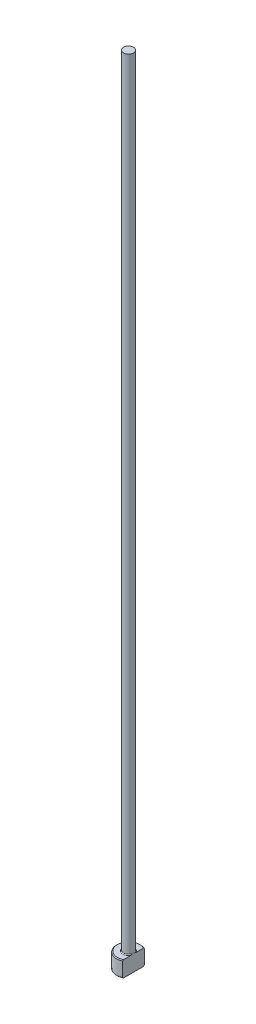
ISO-10303-21;
HEADER;
FILE_DESCRIPTION(('STEP AP214'),'2;1');
FILE_NAME('part.step','',(''),(''),'','','');
FILE_SCHEMA(('AUTOMOTIVE_DESIGN { 1 0 10303 214 1 1 1 1 }'));
ENDSEC;
DATA;
#1=APPLICATION_CONTEXT('core data for automotive mechanical design processes');
#2=APPLICATION_PROTOCOL_DEFINITION('international standard','automotive_design',2000,#1);
#3=PRODUCT_CONTEXT('',#1,'mechanical');
#4=PRODUCT('Part','Part','',(#3));
#5=PRODUCT_RELATED_PRODUCT_CATEGORY('part','',(#4));
#6=PRODUCT_DEFINITION_FORMATION('','',#4);
#7=PRODUCT_DEFINITION_CONTEXT('part definition',#1,'design');
#8=PRODUCT_DEFINITION('design','',#6,#7);
#9=PRODUCT_DEFINITION_SHAPE('','',#8);
#10=(LENGTH_UNIT() NAMED_UNIT(*) SI_UNIT(.MILLI.,.METRE.));
#11=(NAMED_UNIT(*) PLANE_ANGLE_UNIT() SI_UNIT($,.RADIAN.));
#12=(NAMED_UNIT(*) SI_UNIT($,.STERADIAN.) SOLID_ANGLE_UNIT());
#13=UNCERTAINTY_MEASURE_WITH_UNIT(LENGTH_MEASURE(1.E-05),#10,'distance_accuracy_value','');
#14=(GEOMETRIC_REPRESENTATION_CONTEXT(3) GLOBAL_UNCERTAINTY_ASSIGNED_CONTEXT((#13)) GLOBAL_UNIT_ASSIGNED_CONTEXT((#10,
#11,#12)) REPRESENTATION_CONTEXT('',''));
#15=CARTESIAN_POINT('',(0.,0.,0.));
#16=DIRECTION('',(0.,0.,1.));
#17=DIRECTION('',(1.,0.,0.));
#18=AXIS2_PLACEMENT_3D('',#15,#16,#17);
#19=CARTESIAN_POINT('',(0.,0.,0.));
#20=DIRECTION('',(0.,-1.,0.));
#21=DIRECTION('',(0.,0.,-1.));
#22=AXIS2_PLACEMENT_3D('',#19,#20,#21);
#23=PLANE('',#22);
#24=CARTESIAN_POINT('',(0.,0.,0.));
#25=DIRECTION('',(0.,-1.,0.));
#26=DIRECTION('',(0.,0.,-1.));
#27=AXIS2_PLACEMENT_3D('',#24,#25,#26);
#28=CIRCLE('',#27,2.79999999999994);
#29=CARTESIAN_POINT('',(1.24999999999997,0.,2.50549396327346));
#30=VERTEX_POINT('',#29);
#31=CARTESIAN_POINT('',(1.24999999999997,0.,-2.50549396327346));
#32=VERTEX_POINT('',#31);
#33=EDGE_CURVE('E98',#30,#32,#28,.T.);
#34=ORIENTED_EDGE('',*,*,#33,.T.);
#35=DIRECTION('',(0.,0.,1.));
#36=VECTOR('',#35,1.);
#37=CARTESIAN_POINT('',(1.24999999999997,0.,2.72717802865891));
#38=LINE('',#37,#36);
#39=EDGE_CURVE('E83',#32,#30,#38,.T.);
#40=ORIENTED_EDGE('',*,*,#39,.T.);
#41=EDGE_LOOP('',(#34,#40));
#42=FACE_BOUND('',#41,.T.);
#43=ADVANCED_FACE('F32',(#42),#23,.T.);
#44=CARTESIAN_POINT('',(0.,259.958771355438,0.));
#45=DIRECTION('',(0.,1.,0.));
#46=DIRECTION('',(0.,0.,1.));
#47=AXIS2_PLACEMENT_3D('',#44,#45,#46);
#48=CYLINDRICAL_SURFACE('',#47,2.99999999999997);
#49=CARTESIAN_POINT('',(0.,3.79999999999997,0.));
#50=DIRECTION('',(0.,1.,0.));
#51=DIRECTION('',(0.,0.,1.));
#52=AXIS2_PLACEMENT_3D('',#49,#50,#51);
#53=CIRCLE('',#52,2.99999999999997);
#54=CARTESIAN_POINT('',(1.24999999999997,3.79999999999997,2.72717802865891));
#55=VERTEX_POINT('',#54);
#56=CARTESIAN_POINT('',(1.24999999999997,3.79999999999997,-2.72717802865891));
#57=VERTEX_POINT('',#56);
#58=EDGE_CURVE('E104',#55,#57,#53,.F.);
#59=ORIENTED_EDGE('',*,*,#58,.T.);
#60=DIRECTION('',(0.,-1.,0.));
#61=VECTOR('',#60,1.);
#62=CARTESIAN_POINT('',(1.24999999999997,200.,-2.72717802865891));
#63=LINE('',#62,#61);
#64=CARTESIAN_POINT('',(1.24999999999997,0.200000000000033,-2.72717802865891));
#65=VERTEX_POINT('',#64);
#66=EDGE_CURVE('E183',#57,#65,#63,.T.);
#67=ORIENTED_EDGE('',*,*,#66,.T.);
#68=CARTESIAN_POINT('',(0.,0.200000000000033,0.));
#69=DIRECTION('',(0.,-1.,0.));
#70=DIRECTION('',(0.,0.,-1.));
#71=AXIS2_PLACEMENT_3D('',#68,#69,#70);
#72=CIRCLE('',#71,2.99999999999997);
#73=CARTESIAN_POINT('',(1.24999999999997,0.200000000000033,2.72717802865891));
#74=VERTEX_POINT('',#73);
#75=EDGE_CURVE('E100',#65,#74,#72,.F.);
#76=ORIENTED_EDGE('',*,*,#75,.T.);
#77=DIRECTION('',(0.,-1.,0.));
#78=VECTOR('',#77,1.);
#79=CARTESIAN_POINT('',(1.24999999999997,200.,2.72717802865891));
#80=LINE('',#79,#78);
#81=EDGE_CURVE('E93',#55,#74,#80,.T.);
#82=ORIENTED_EDGE('',*,*,#81,.F.);
#83=EDGE_LOOP('',(#59,#67,#76,#82));
#84=FACE_BOUND('',#83,.T.);
#85=ADVANCED_FACE('F158',(#84),#48,.T.);
#86=CARTESIAN_POINT('',(-2.99999999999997,4.,0.));
#87=DIRECTION('',(0.,1.,0.));
#88=DIRECTION('',(0.,0.,1.));
#89=AXIS2_PLACEMENT_3D('',#86,#87,#88);
#90=PLANE('',#89);
#91=CARTESIAN_POINT('',(0.,4.,0.));
#92=DIRECTION('',(0.,1.,0.));
#93=DIRECTION('',(0.,0.,1.));
#94=AXIS2_PLACEMENT_3D('',#91,#92,#93);
#95=CIRCLE('',#94,2.79999999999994);
#96=CARTESIAN_POINT('',(1.24999999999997,4.,-2.50549396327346));
#97=VERTEX_POINT('',#96);
#98=CARTESIAN_POINT('',(1.24999999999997,4.,2.50549396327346));
#99=VERTEX_POINT('',#98);
#100=EDGE_CURVE('E178',#97,#99,#95,.T.);
#101=ORIENTED_EDGE('',*,*,#100,.T.);
#102=DIRECTION('',(0.,0.,-1.));
#103=VECTOR('',#102,1.);
#104=CARTESIAN_POINT('',(1.24999999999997,4.,0.));
#105=LINE('',#104,#103);
#106=CARTESIAN_POINT('',(1.24999999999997,3.99999999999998,0.734846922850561));
#107=VERTEX_POINT('',#106);
#108=EDGE_CURVE('E57',#99,#107,#105,.T.);
#109=ORIENTED_EDGE('',*,*,#108,.T.);
#110=CARTESIAN_POINT('',(0.,4.,0.));
#111=DIRECTION('',(0.,1.,0.));
#112=DIRECTION('',(0.,0.,1.));
#113=AXIS2_PLACEMENT_3D('',#110,#111,#112);
#114=CIRCLE('',#113,1.44999999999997);
#115=CARTESIAN_POINT('',(1.24999999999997,3.99999999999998,-0.734846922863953));
#116=VERTEX_POINT('',#115);
#117=EDGE_CURVE('E107',#107,#116,#114,.F.);
#118=ORIENTED_EDGE('',*,*,#117,.T.);
#119=EDGE_CURVE('E136',#116,#97,#105,.T.);
#120=ORIENTED_EDGE('',*,*,#119,.T.);
#121=EDGE_LOOP('',(#101,#109,#118,#120));
#122=FACE_BOUND('',#121,.T.);
#123=ADVANCED_FACE('F147',(#122),#90,.T.);
#124=CARTESIAN_POINT('',(0.,4.,0.));
#125=DIRECTION('',(0.,-1.,0.));
#126=DIRECTION('',(0.,0.,-1.));
#127=AXIS2_PLACEMENT_3D('',#124,#125,#126);
#128=CONICAL_SURFACE('',#127,2.79999999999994,0.785398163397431);
#129=ORIENTED_EDGE('',*,*,#58,.F.);
#130=CARTESIAN_POINT('',(1.24999999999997,0.669029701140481,6.00219100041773));
#131=CARTESIAN_POINT('',(1.24999999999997,0.811608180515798,5.85654654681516));
#132=CARTESIAN_POINT('',(1.24999999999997,0.954083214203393,5.71080056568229));
#133=CARTESIAN_POINT('',(1.24999999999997,1.23900024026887,5.41878816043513));
#134=CARTESIAN_POINT('',(1.24999999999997,1.3814417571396,5.27252127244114));
#135=CARTESIAN_POINT('',(1.24999999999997,1.67009506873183,4.97540906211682));
#136=CARTESIAN_POINT('',(1.24999999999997,1.81629662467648,4.82455378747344));
#137=CARTESIAN_POINT('',(1.24999999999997,2.10796282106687,4.52263591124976));
#138=CARTESIAN_POINT('',(1.24999999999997,2.25342829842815,4.37157411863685));
#139=CARTESIAN_POINT('',(1.24999999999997,2.53664042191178,4.07620034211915));
#140=CARTESIAN_POINT('',(1.24999999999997,2.67441792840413,3.9319179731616));
#141=CARTESIAN_POINT('',(1.24999999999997,2.94919792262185,3.64255917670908));
#142=CARTESIAN_POINT('',(1.24999999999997,3.08620024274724,3.49748258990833));
#143=CARTESIAN_POINT('',(1.24999999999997,3.36003302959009,3.2052316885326));
#144=CARTESIAN_POINT('',(1.24999999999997,3.49685542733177,3.05804979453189));
#145=CARTESIAN_POINT('',(1.24999999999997,3.76866895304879,2.76222351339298));
#146=CARTESIAN_POINT('',(1.24999999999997,3.90366148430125,2.61358041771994));
#147=CARTESIAN_POINT('',(1.24999999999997,4.1672507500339,2.31803303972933));
#148=CARTESIAN_POINT('',(1.24999999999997,4.29592101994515,2.17119494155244));
#149=CARTESIAN_POINT('',(1.24999999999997,4.48585031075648,1.94789558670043));
#150=CARTESIAN_POINT('',(1.24999999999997,4.54874737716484,1.87283059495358));
#151=CARTESIAN_POINT('',(1.24999999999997,4.67301560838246,1.72146479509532));
#152=CARTESIAN_POINT('',(1.24999999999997,4.7343870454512,1.64516421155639));
#153=CARTESIAN_POINT('',(1.24999999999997,4.85417557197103,1.49197305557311));
#154=CARTESIAN_POINT('',(1.24999999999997,4.91262187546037,1.41510543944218));
#155=CARTESIAN_POINT('',(1.24999999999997,5.02658525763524,1.25910555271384));
#156=CARTESIAN_POINT('',(1.24999999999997,5.08209990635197,1.17997148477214));
#157=CARTESIAN_POINT('',(1.24999999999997,5.18831713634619,1.0191471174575));
#158=CARTESIAN_POINT('',(1.24999999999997,5.23904487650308,0.937473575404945));
#159=CARTESIAN_POINT('',(1.24999999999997,5.33341065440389,0.770163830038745));
#160=CARTESIAN_POINT('',(1.24999999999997,5.37706287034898,0.684536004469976));
#161=CARTESIAN_POINT('',(1.24999999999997,5.42311846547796,0.577571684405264));
#162=CARTESIAN_POINT('',(1.24999999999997,5.43098597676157,0.558575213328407));
#163=CARTESIAN_POINT('',(1.24999999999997,5.44613719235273,0.520340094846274));
#164=CARTESIAN_POINT('',(1.24999999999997,5.45342063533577,0.501101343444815));
#165=CARTESIAN_POINT('',(1.24999999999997,5.46734064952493,0.462392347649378));
#166=CARTESIAN_POINT('',(1.24999999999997,5.47397728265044,0.4429221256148));
#167=CARTESIAN_POINT('',(1.24999999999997,5.48654090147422,0.403756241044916));
#168=CARTESIAN_POINT('',(1.24999999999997,5.49246793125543,0.384060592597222));
#169=CARTESIAN_POINT('',(1.24999999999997,5.50889838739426,0.325328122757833));
#170=CARTESIAN_POINT('',(1.24999999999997,5.51829705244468,0.285972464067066));
#171=CARTESIAN_POINT('',(1.24999999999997,5.53364447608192,0.206573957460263));
#172=CARTESIAN_POINT('',(1.24999999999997,5.53959211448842,0.166530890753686));
#173=CARTESIAN_POINT('',(1.24999999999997,5.54775364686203,0.0853257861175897));
#174=CARTESIAN_POINT('',(1.24999999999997,5.54989812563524,0.0441566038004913));
#175=CARTESIAN_POINT('',(1.24999999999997,5.55009472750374,-0.0381787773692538));
#176=CARTESIAN_POINT('',(1.24999999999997,5.54814807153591,-0.0793449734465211));
#177=CARTESIAN_POINT('',(1.24999999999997,5.54028608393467,-0.161410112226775));
#178=CARTESIAN_POINT('',(1.24999999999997,5.53435930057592,-0.202307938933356));
#179=CARTESIAN_POINT('',(1.24999999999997,5.51889139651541,-0.283420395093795));
#180=CARTESIAN_POINT('',(1.24999999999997,5.50934853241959,-0.323634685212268));
#181=CARTESIAN_POINT('',(1.24999999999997,5.48253027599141,-0.419701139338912));
#182=CARTESIAN_POINT('',(1.24999999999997,5.46368943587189,-0.475114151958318));
#183=CARTESIAN_POINT('',(1.24999999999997,5.42119888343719,-0.584051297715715));
#184=CARTESIAN_POINT('',(1.24999999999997,5.3975461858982,-0.637574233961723));
#185=CARTESIAN_POINT('',(1.24999999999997,5.3465015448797,-0.743173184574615));
#186=CARTESIAN_POINT('',(1.24999999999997,5.31908834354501,-0.795238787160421));
#187=CARTESIAN_POINT('',(1.24999999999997,5.26156746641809,-0.897817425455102));
#188=CARTESIAN_POINT('',(1.24999999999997,5.23146075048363,-0.948331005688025));
#189=CARTESIAN_POINT('',(1.24999999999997,5.16421238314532,-1.05610178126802));
#190=CARTESIAN_POINT('',(1.24999999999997,5.12671791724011,-1.11313743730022));
#191=CARTESIAN_POINT('',(1.24999999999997,5.04971534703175,-1.22583866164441));
#192=CARTESIAN_POINT('',(1.24999999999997,5.01020681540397,-1.28150393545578));
#193=CARTESIAN_POINT('',(1.24999999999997,4.88938978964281,-1.44694956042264));
#194=CARTESIAN_POINT('',(1.24999999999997,4.80584655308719,-1.55509257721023));
#195=CARTESIAN_POINT('',(1.24999999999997,4.63502000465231,-1.76881938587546));
#196=CARTESIAN_POINT('',(1.24999999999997,4.54772710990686,-1.87439538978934));
#197=CARTESIAN_POINT('',(1.24999999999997,4.37088701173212,-2.08355531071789));
#198=CARTESIAN_POINT('',(1.24999999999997,4.28134083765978,-2.18714010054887));
#199=CARTESIAN_POINT('',(1.24999999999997,4.10042772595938,-2.39324626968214));
#200=CARTESIAN_POINT('',(1.24999999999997,4.00905617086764,-2.49576357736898));
#201=CARTESIAN_POINT('',(1.24999999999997,3.82518962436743,-2.69980391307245));
#202=CARTESIAN_POINT('',(1.24999999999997,3.73269451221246,-2.80132683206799));
#203=CARTESIAN_POINT('',(1.24999999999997,3.45429710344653,-3.10446128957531));
#204=CARTESIAN_POINT('',(1.24999999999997,3.26719139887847,-3.30496607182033));
#205=CARTESIAN_POINT('',(1.24999999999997,2.87989899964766,-3.71613563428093));
#206=CARTESIAN_POINT('',(1.24999999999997,2.67959819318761,-3.92669240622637));
#207=CARTESIAN_POINT('',(1.24999999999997,2.27757992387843,-4.34666060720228));
#208=CARTESIAN_POINT('',(1.24999999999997,2.07586177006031,-4.55607137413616));
#209=CARTESIAN_POINT('',(1.24999999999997,1.6735666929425,-4.97197982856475));
#210=CARTESIAN_POINT('',(1.24999999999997,1.47299831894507,-5.17848579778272));
#211=CARTESIAN_POINT('',(1.24999999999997,1.07135927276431,-5.59078665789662));
#212=CARTESIAN_POINT('',(1.24999999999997,0.87028893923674,-5.79658187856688));
#213=CARTESIAN_POINT('',(1.24999999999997,0.669029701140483,-6.00219100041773));
#214=B_SPLINE_CURVE_WITH_KNOTS('',3,(#130,#131,#132,#133,#134,#135,#136,#137,#138,#139,#140,
#141,#142,#143,#144,#145,#146,#147,#148,#149,#150,#151,#152,#153,#154,#155,#156,#157,#158,#159,
#160,#161,#162,#163,#164,#165,#166,#167,#168,#169,#170,#171,#172,#173,#174,#175,#176,#177,#178,
#179,#180,#181,#182,#183,#184,#185,#186,#187,#188,#189,#190,#191,#192,#193,#194,#195,#196,#197,
#198,#199,#200,#201,#202,#203,#204,#205,#206,#207,#208,#209,#210,#211,#212,#213),.UNSPECIFIED.,
.F.,.F.,(4,2,2,2,2,2,2,2,2,2,2,2,2,2,2,2,2,2,2,2,2,2,2,2,2,2,2,2,2,2,2,2,2,2,2,2,2,2,2,2,2,4),
(0.,0.611447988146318,1.22394436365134,1.85417356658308,2.48331351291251,3.08180969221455,
3.68043067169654,4.28328558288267,4.88564854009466,5.47129854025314,5.76508275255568,
6.05881415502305,6.34846123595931,6.63834474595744,6.92660821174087,7.21428670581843,
7.27596254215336,7.33766582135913,7.39936318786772,7.4610567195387,7.58229876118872,
7.70358013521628,7.82705319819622,7.95048941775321,8.07428232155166,8.19813498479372,
8.37340718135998,8.54878844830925,8.72520546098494,8.90155985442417,9.10626834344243,
9.31102044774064,9.72083602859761,10.1317697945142,10.5425191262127,10.9544882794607,
11.3665021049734,12.1892148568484,13.0610401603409,13.9333249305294,14.7969505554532,
15.660099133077),.UNSPECIFIED.);
#215=EDGE_CURVE('E135',#55,#99,#214,.T.);
#216=ORIENTED_EDGE('',*,*,#215,.T.);
#217=ORIENTED_EDGE('',*,*,#100,.F.);
#218=EDGE_CURVE('E127',#97,#57,#214,.T.);
#219=ORIENTED_EDGE('',*,*,#218,.T.);
#220=EDGE_LOOP('',(#129,#216,#217,#219));
#221=FACE_BOUND('',#220,.T.);
#222=ADVANCED_FACE('F143',(#221),#128,.T.);
#223=CARTESIAN_POINT('',(0.,0.200000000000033,0.));
#224=DIRECTION('',(0.,1.,0.));
#225=DIRECTION('',(0.,0.,1.));
#226=AXIS2_PLACEMENT_3D('',#223,#224,#225);
#227=CONICAL_SURFACE('',#226,2.99999999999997,0.785398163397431);
#228=ORIENTED_EDGE('',*,*,#75,.F.);
#229=CARTESIAN_POINT('',(1.24999999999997,3.33097029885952,-6.00219100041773));
#230=CARTESIAN_POINT('',(1.24999999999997,3.18839181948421,-5.85654654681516));
#231=CARTESIAN_POINT('',(1.24999999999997,3.04591678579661,-5.71080056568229));
#232=CARTESIAN_POINT('',(1.24999999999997,2.76099975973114,-5.41878816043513));
#233=CARTESIAN_POINT('',(1.24999999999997,2.61855824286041,-5.27252127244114));
#234=CARTESIAN_POINT('',(1.24999999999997,2.32990493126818,-4.97540906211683));
#235=CARTESIAN_POINT('',(1.24999999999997,2.18370337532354,-4.82455378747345));
#236=CARTESIAN_POINT('',(1.24999999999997,1.89203717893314,-4.52263591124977));
#237=CARTESIAN_POINT('',(1.24999999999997,1.74657170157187,-4.37157411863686));
#238=CARTESIAN_POINT('',(1.24999999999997,1.46335957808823,-4.07620034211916));
#239=CARTESIAN_POINT('',(1.24999999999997,1.32558207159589,-3.93191797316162));
#240=CARTESIAN_POINT('',(1.24999999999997,1.05080207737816,-3.64255917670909));
#241=CARTESIAN_POINT('',(1.24999999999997,0.913799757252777,-3.49748258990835));
#242=CARTESIAN_POINT('',(1.24999999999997,0.639966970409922,-3.2052316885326));
#243=CARTESIAN_POINT('',(1.24999999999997,0.503144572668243,-3.0580497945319));
#244=CARTESIAN_POINT('',(1.24999999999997,0.231331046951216,-2.76222351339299));
#245=CARTESIAN_POINT('',(1.24999999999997,0.09633851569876,-2.61358041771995));
#246=CARTESIAN_POINT('',(1.24999999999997,-0.167250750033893,-2.31803303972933));
#247=CARTESIAN_POINT('',(1.24999999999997,-0.295921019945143,-2.17119494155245));
#248=CARTESIAN_POINT('',(1.24999999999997,-0.485850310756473,-1.94789558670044));
#249=CARTESIAN_POINT('',(1.24999999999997,-0.54874737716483,-1.87283059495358));
#250=CARTESIAN_POINT('',(1.24999999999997,-0.673015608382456,-1.72146479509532));
#251=CARTESIAN_POINT('',(1.24999999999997,-0.734387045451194,-1.64516421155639));
#252=CARTESIAN_POINT('',(1.24999999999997,-0.854175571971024,-1.49197305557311));
#253=CARTESIAN_POINT('',(1.24999999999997,-0.912621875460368,-1.41510543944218));
#254=CARTESIAN_POINT('',(1.24999999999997,-1.02658525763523,-1.25910555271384));
#255=CARTESIAN_POINT('',(1.24999999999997,-1.08209990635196,-1.17997148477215));
#256=CARTESIAN_POINT('',(1.24999999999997,-1.18831713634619,-1.0191471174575));
#257=CARTESIAN_POINT('',(1.24999999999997,-1.23904487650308,-0.937473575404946));
#258=CARTESIAN_POINT('',(1.24999999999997,-1.33341065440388,-0.770163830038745));
#259=CARTESIAN_POINT('',(1.24999999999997,-1.37706287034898,-0.684536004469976));
#260=CARTESIAN_POINT('',(1.24999999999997,-1.42311846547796,-0.577571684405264));
#261=CARTESIAN_POINT('',(1.24999999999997,-1.43098597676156,-0.558575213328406));
#262=CARTESIAN_POINT('',(1.24999999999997,-1.44613719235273,-0.520340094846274));
#263=CARTESIAN_POINT('',(1.24999999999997,-1.45342063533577,-0.501101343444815));
#264=CARTESIAN_POINT('',(1.24999999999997,-1.46734064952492,-0.462392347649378));
#265=CARTESIAN_POINT('',(1.24999999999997,-1.47397728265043,-0.4429221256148));
#266=CARTESIAN_POINT('',(1.24999999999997,-1.48654090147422,-0.403756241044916));
#267=CARTESIAN_POINT('',(1.24999999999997,-1.49246793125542,-0.384060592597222));
#268=CARTESIAN_POINT('',(1.24999999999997,-1.50889838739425,-0.325328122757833));
#269=CARTESIAN_POINT('',(1.24999999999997,-1.51829705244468,-0.285972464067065));
#270=CARTESIAN_POINT('',(1.24999999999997,-1.53364447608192,-0.206573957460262));
#271=CARTESIAN_POINT('',(1.24999999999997,-1.53959211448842,-0.166530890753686));
#272=CARTESIAN_POINT('',(1.24999999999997,-1.54775364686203,-0.0853257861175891));
#273=CARTESIAN_POINT('',(1.24999999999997,-1.54989812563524,-0.0441566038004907));
#274=CARTESIAN_POINT('',(1.24999999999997,-1.55009472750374,0.0381787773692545));
#275=CARTESIAN_POINT('',(1.24999999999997,-1.5481480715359,0.0793449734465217));
#276=CARTESIAN_POINT('',(1.24999999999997,-1.54028608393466,0.161410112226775));
#277=CARTESIAN_POINT('',(1.24999999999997,-1.53435930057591,0.202307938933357));
#278=CARTESIAN_POINT('',(1.24999999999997,-1.5188913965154,0.283420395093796));
#279=CARTESIAN_POINT('',(1.24999999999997,-1.50934853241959,0.323634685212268));
#280=CARTESIAN_POINT('',(1.24999999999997,-1.48253027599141,0.419701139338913));
#281=CARTESIAN_POINT('',(1.24999999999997,-1.46368943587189,0.475114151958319));
#282=CARTESIAN_POINT('',(1.24999999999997,-1.42119888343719,0.584051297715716));
#283=CARTESIAN_POINT('',(1.24999999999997,-1.39754618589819,0.637574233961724));
#284=CARTESIAN_POINT('',(1.24999999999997,-1.3465015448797,0.743173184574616));
#285=CARTESIAN_POINT('',(1.24999999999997,-1.319088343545,0.795238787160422));
#286=CARTESIAN_POINT('',(1.24999999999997,-1.26156746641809,0.897817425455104));
#287=CARTESIAN_POINT('',(1.24999999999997,-1.23146075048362,0.948331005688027));
#288=CARTESIAN_POINT('',(1.24999999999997,-1.16421238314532,1.05610178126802));
#289=CARTESIAN_POINT('',(1.24999999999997,-1.1267179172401,1.11313743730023));
#290=CARTESIAN_POINT('',(1.24999999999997,-1.04971534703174,1.22583866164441));
#291=CARTESIAN_POINT('',(1.24999999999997,-1.01020681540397,1.28150393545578));
#292=CARTESIAN_POINT('',(1.24999999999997,-0.889389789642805,1.44694956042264));
#293=CARTESIAN_POINT('',(1.24999999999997,-0.805846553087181,1.55509257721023));
#294=CARTESIAN_POINT('',(1.24999999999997,-0.635020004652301,1.76881938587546));
#295=CARTESIAN_POINT('',(1.24999999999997,-0.547727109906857,1.87439538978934));
#296=CARTESIAN_POINT('',(1.24999999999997,-0.370887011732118,2.08355531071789));
#297=CARTESIAN_POINT('',(1.24999999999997,-0.281340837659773,2.18714010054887));
#298=CARTESIAN_POINT('',(1.24999999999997,-0.100427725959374,2.39324626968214));
#299=CARTESIAN_POINT('',(1.24999999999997,-0.00905617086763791,2.49576357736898));
#300=CARTESIAN_POINT('',(1.24999999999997,0.174810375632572,2.69980391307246));
#301=CARTESIAN_POINT('',(1.24999999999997,0.267305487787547,2.801326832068));
#302=CARTESIAN_POINT('',(1.24999999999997,0.545702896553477,3.10446128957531));
#303=CARTESIAN_POINT('',(1.24999999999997,0.73280860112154,3.30496607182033));
#304=CARTESIAN_POINT('',(1.24999999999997,1.12010100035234,3.71613563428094));
#305=CARTESIAN_POINT('',(1.24999999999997,1.3204018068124,3.92669240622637));
#306=CARTESIAN_POINT('',(1.24999999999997,1.72242007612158,4.34666060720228));
#307=CARTESIAN_POINT('',(1.24999999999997,1.92413822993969,4.55607137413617));
#308=CARTESIAN_POINT('',(1.24999999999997,2.32643330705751,4.97197982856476));
#309=CARTESIAN_POINT('',(1.24999999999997,2.52700168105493,5.17848579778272));
#310=CARTESIAN_POINT('',(1.24999999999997,2.92864072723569,5.59078665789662));
#311=CARTESIAN_POINT('',(1.24999999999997,3.12971106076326,5.79658187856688));
#312=CARTESIAN_POINT('',(1.24999999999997,3.33097029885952,6.00219100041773));
#313=B_SPLINE_CURVE_WITH_KNOTS('',3,(#229,#230,#231,#232,#233,#234,#235,#236,#237,#238,#239,
#240,#241,#242,#243,#244,#245,#246,#247,#248,#249,#250,#251,#252,#253,#254,#255,#256,#257,#258,
#259,#260,#261,#262,#263,#264,#265,#266,#267,#268,#269,#270,#271,#272,#273,#274,#275,#276,#277,
#278,#279,#280,#281,#282,#283,#284,#285,#286,#287,#288,#289,#290,#291,#292,#293,#294,#295,#296,
#297,#298,#299,#300,#301,#302,#303,#304,#305,#306,#307,#308,#309,#310,#311,#312),.UNSPECIFIED.,
.F.,.F.,(4,2,2,2,2,2,2,2,2,2,2,2,2,2,2,2,2,2,2,2,2,2,2,2,2,2,2,2,2,2,2,2,2,2,2,2,2,2,2,2,2,4),
(0.,0.611447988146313,1.22394436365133,1.85417356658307,2.48331351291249,3.08180969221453,
3.68043067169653,4.28328558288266,4.88564854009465,5.47129854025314,5.76508275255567,
6.05881415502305,6.3484612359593,6.63834474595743,6.92660821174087,7.21428670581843,
7.27596254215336,7.33766582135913,7.39936318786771,7.4610567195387,7.58229876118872,
7.70358013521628,7.82705319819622,7.95048941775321,8.07428232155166,8.19813498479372,
8.37340718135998,8.54878844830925,8.72520546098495,8.90155985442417,9.10626834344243,
9.31102044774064,9.72083602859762,10.1317697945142,10.5425191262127,10.9544882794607,
11.3665021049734,12.1892148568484,13.0610401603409,13.9333249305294,14.7969505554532,
15.660099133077),.UNSPECIFIED.);
#314=EDGE_CURVE('E86',#65,#32,#313,.T.);
#315=ORIENTED_EDGE('',*,*,#314,.T.);
#316=ORIENTED_EDGE('',*,*,#33,.F.);
#317=EDGE_CURVE('E89',#30,#74,#313,.T.);
#318=ORIENTED_EDGE('',*,*,#317,.T.);
#319=EDGE_LOOP('',(#228,#315,#316,#318));
#320=FACE_BOUND('',#319,.T.);
#321=ADVANCED_FACE('F97',(#320),#227,.T.);
#322=CARTESIAN_POINT('',(0.,4.19999999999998,0.));
#323=DIRECTION('',(0.,1.,0.));
#324=DIRECTION('',(0.,0.,1.));
#325=AXIS2_PLACEMENT_3D('',#322,#323,#324);
#326=TOROIDAL_SURFACE('',#325,1.44999999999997,0.2);
#327=CARTESIAN_POINT('',(1.24999999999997,4.19999999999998,0.));
#328=CARTESIAN_POINT('',(1.24999999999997,4.20000051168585,-1.97679442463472E-10));
#329=CARTESIAN_POINT('',(1.24999999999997,4.2000010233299,-1.08908064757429E-07));
#330=CARTESIAN_POINT('',(1.24999999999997,4.2000020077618,-4.52594763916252E-07));
#331=CARTESIAN_POINT('',(1.24999999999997,4.20000247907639,-6.9099304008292E-07));
#332=CARTESIAN_POINT('',(1.24999999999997,4.20000341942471,-1.26357943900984E-06));
#333=CARTESIAN_POINT('',(1.24999999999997,4.20000388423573,-1.60457618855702E-06));
#334=CARTESIAN_POINT('',(1.24999999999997,4.20000476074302,-2.3395490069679E-06));
#335=CARTESIAN_POINT('',(1.24999999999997,4.20000517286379,-2.73304148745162E-06));
#336=CARTESIAN_POINT('',(1.24999999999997,4.20000655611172,-4.1454401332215E-06));
#337=CARTESIAN_POINT('',(1.24999999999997,4.20000745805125,-5.23310092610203E-06));
#338=CARTESIAN_POINT('',(1.24999999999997,4.20000906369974,-7.47950361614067E-06));
#339=CARTESIAN_POINT('',(1.24999999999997,4.20000977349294,-8.63414438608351E-06));
#340=CARTESIAN_POINT('',(1.24999999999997,4.20001244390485,-1.31453477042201E-05));
#341=CARTESIAN_POINT('',(1.24999999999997,4.20001426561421,-1.65880555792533E-05));
#342=CARTESIAN_POINT('',(1.24999999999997,4.20001724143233,-2.33729029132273E-05));
#343=CARTESIAN_POINT('',(1.24999999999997,4.20001844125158,-2.66956154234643E-05));
#344=CARTESIAN_POINT('',(1.24999999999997,4.20002354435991,-4.08635086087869E-05));
#345=CARTESIAN_POINT('',(1.24999999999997,4.2000274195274,-5.17114614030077E-05));
#346=CARTESIAN_POINT('',(1.24999999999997,4.2000336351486,-7.2005767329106E-05));
#347=CARTESIAN_POINT('',(1.24999999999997,4.2000361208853,-8.14057065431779E-05));
#348=CARTESIAN_POINT('',(1.24999999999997,4.20005581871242,-0.00014978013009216));
#349=CARTESIAN_POINT('',(1.24999999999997,4.20008094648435,-0.000206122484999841));
#350=CARTESIAN_POINT('',(1.24999999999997,4.20017507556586,-0.000425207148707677));
#351=CARTESIAN_POINT('',(1.24999999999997,4.20023819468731,-0.000589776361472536));
#352=CARTESIAN_POINT('',(1.24999999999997,4.20048692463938,-0.00122878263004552));
#353=CARTESIAN_POINT('',(1.24999999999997,4.20067870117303,-0.00170134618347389));
#354=CARTESIAN_POINT('',(1.24999999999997,4.20146022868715,-0.00363636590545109));
#355=CARTESIAN_POINT('',(1.24999999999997,4.20204298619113,-0.0051009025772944));
#356=CARTESIAN_POINT('',(1.24999999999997,4.20939719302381,-0.0235712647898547));
#357=CARTESIAN_POINT('',(1.24999999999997,4.21621259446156,-0.0405643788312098));
#358=CARTESIAN_POINT('',(1.24999999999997,4.22951000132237,-0.0739606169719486));
#359=CARTESIAN_POINT('',(1.24999999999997,4.23599508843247,-0.0903626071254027));
#360=CARTESIAN_POINT('',(1.24999999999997,4.24961430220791,-0.12511129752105));
#361=CARTESIAN_POINT('',(1.24999999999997,4.25673641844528,-0.143462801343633));
#362=CARTESIAN_POINT('',(1.24999999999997,4.27085039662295,-0.180427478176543));
#363=CARTESIAN_POINT('',(1.24999999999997,4.27784022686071,-0.199041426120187));
#364=CARTESIAN_POINT('',(1.24999999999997,4.29479134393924,-0.245221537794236));
#365=CARTESIAN_POINT('',(1.24999999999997,4.30459026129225,-0.272848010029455));
#366=CARTESIAN_POINT('',(1.24999999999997,4.32310234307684,-0.327738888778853));
#367=CARTESIAN_POINT('',(1.24999999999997,4.3318356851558,-0.354996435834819));
#368=CARTESIAN_POINT('',(1.24999999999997,4.34936561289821,-0.413744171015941));
#369=CARTESIAN_POINT('',(1.24999999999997,4.35799470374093,-0.445285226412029));
#370=CARTESIAN_POINT('',(1.24999999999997,4.37338463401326,-0.50909191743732));
#371=CARTESIAN_POINT('',(1.24999999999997,4.38013036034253,-0.541361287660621));
#372=CARTESIAN_POINT('',(1.24999999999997,4.39136059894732,-0.608339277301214));
#373=CARTESIAN_POINT('',(1.24999999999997,4.39568167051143,-0.643076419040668));
#374=CARTESIAN_POINT('',(1.24999999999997,4.40037605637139,-0.712733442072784));
#375=CARTESIAN_POINT('',(1.24999999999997,4.40076553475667,-0.747651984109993));
#376=CARTESIAN_POINT('',(1.24999999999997,4.39677668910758,-0.808103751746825));
#377=CARTESIAN_POINT('',(1.24999999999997,4.39361441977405,-0.833711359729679));
#378=CARTESIAN_POINT('',(1.24999999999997,4.38355990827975,-0.883915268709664));
#379=CARTESIAN_POINT('',(1.24999999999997,4.37671813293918,-0.908520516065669));
#380=CARTESIAN_POINT('',(1.24999999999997,4.36252570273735,-0.944879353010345));
#381=CARTESIAN_POINT('',(1.24999999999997,4.35688428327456,-0.957298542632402));
#382=CARTESIAN_POINT('',(1.24999999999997,4.34399066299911,-0.981318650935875));
#383=CARTESIAN_POINT('',(1.24999999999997,4.33673636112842,-0.992918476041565));
#384=CARTESIAN_POINT('',(1.24999999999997,4.32199744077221,-1.01267533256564));
#385=CARTESIAN_POINT('',(1.24999999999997,4.31482723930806,-1.02106482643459));
#386=CARTESIAN_POINT('',(1.24999999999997,4.29924321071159,-1.03659690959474));
#387=CARTESIAN_POINT('',(1.24999999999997,4.29083198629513,-1.04374204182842));
#388=CARTESIAN_POINT('',(1.24999999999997,4.27498600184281,-1.05478694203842));
#389=CARTESIAN_POINT('',(1.24999999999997,4.26780814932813,-1.059053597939));
#390=CARTESIAN_POINT('',(1.24999999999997,4.25284782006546,-1.06635953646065));
#391=CARTESIAN_POINT('',(1.24999999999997,4.24506572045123,-1.06939957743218));
#392=CARTESIAN_POINT('',(1.24999999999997,4.22901828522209,-1.07404931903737));
#393=CARTESIAN_POINT('',(1.24999999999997,4.22074990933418,-1.07564870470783));
#394=CARTESIAN_POINT('',(1.24999999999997,4.20405985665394,-1.07723717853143));
#395=CARTESIAN_POINT('',(1.24999999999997,4.19563825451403,-1.07722703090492));
#396=CARTESIAN_POINT('',(1.24999999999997,4.17988128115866,-1.07569157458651));
#397=CARTESIAN_POINT('',(1.24999999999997,4.17252879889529,-1.0743339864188));
#398=CARTESIAN_POINT('',(1.24999999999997,4.15814333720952,-1.07044616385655));
#399=CARTESIAN_POINT('',(1.24999999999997,4.15111040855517,-1.06791574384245));
#400=CARTESIAN_POINT('',(1.24999999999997,4.13724955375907,-1.06171920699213));
#401=CARTESIAN_POINT('',(1.24999999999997,4.13043935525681,-1.05801386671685));
#402=CARTESIAN_POINT('',(1.24999999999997,4.11740316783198,-1.04969609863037));
#403=CARTESIAN_POINT('',(1.24999999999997,4.11117742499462,-1.04508329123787));
#404=CARTESIAN_POINT('',(1.24999999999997,4.09586196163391,-1.03220341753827));
#405=CARTESIAN_POINT('',(1.24999999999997,4.08723799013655,-1.02338140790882));
#406=CARTESIAN_POINT('',(1.24999999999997,4.07148817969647,-1.00448021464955));
#407=CARTESIAN_POINT('',(1.24999999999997,4.0643671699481,-0.994397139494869));
#408=CARTESIAN_POINT('',(1.24999999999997,4.04800089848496,-0.967694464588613));
#409=CARTESIAN_POINT('',(1.24999999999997,4.0397014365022,-0.950498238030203));
#410=CARTESIAN_POINT('',(1.24999999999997,4.02582422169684,-0.915117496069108));
#411=CARTESIAN_POINT('',(1.24999999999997,4.02024415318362,-0.896933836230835));
#412=CARTESIAN_POINT('',(1.24999999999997,4.00805724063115,-0.84678106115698));
#413=CARTESIAN_POINT('',(1.24999999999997,4.00359525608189,-0.814297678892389));
#414=CARTESIAN_POINT('',(1.24999999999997,3.99933348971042,-0.748574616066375));
#415=CARTESIAN_POINT('',(1.24999999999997,3.99961552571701,-0.715331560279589));
#416=CARTESIAN_POINT('',(1.24999999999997,4.00446632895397,-0.637920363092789));
#417=CARTESIAN_POINT('',(1.24999999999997,4.0104488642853,-0.593849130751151));
#418=CARTESIAN_POINT('',(1.24999999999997,4.02681929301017,-0.506401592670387));
#419=CARTESIAN_POINT('',(1.24999999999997,4.03722697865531,-0.463029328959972));
#420=CARTESIAN_POINT('',(1.24999999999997,4.06007158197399,-0.380638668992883));
#421=CARTESIAN_POINT('',(1.24999999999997,4.07227412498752,-0.341553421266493));
#422=CARTESIAN_POINT('',(1.24999999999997,4.09824323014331,-0.264347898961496));
#423=CARTESIAN_POINT('',(1.24999999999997,4.11199311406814,-0.226221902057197));
#424=CARTESIAN_POINT('',(1.24999999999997,4.13108825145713,-0.175350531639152));
#425=CARTESIAN_POINT('',(1.24999999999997,4.13599999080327,-0.162438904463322));
#426=CARTESIAN_POINT('',(1.24999999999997,4.14604281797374,-0.136318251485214));
#427=CARTESIAN_POINT('',(1.24999999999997,4.15117629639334,-0.123110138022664));
#428=CARTESIAN_POINT('',(1.24999999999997,4.163417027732,-0.0918425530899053));
#429=CARTESIAN_POINT('',(1.24999999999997,4.1705525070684,-0.0737943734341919));
#430=CARTESIAN_POINT('',(1.24999999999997,4.18426943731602,-0.0393586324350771));
#431=CARTESIAN_POINT('',(1.24999999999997,4.19084281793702,-0.0229681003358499));
#432=CARTESIAN_POINT('',(1.24999999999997,4.19795564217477,-0.00510438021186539));
#433=CARTESIAN_POINT('',(1.24999999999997,4.19853702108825,-0.00364331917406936));
#434=CARTESIAN_POINT('',(1.24999999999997,4.19931818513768,-0.0017091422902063));
#435=CARTESIAN_POINT('',(1.24999999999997,4.1995110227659,-0.00123396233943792));
#436=CARTESIAN_POINT('',(1.24999999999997,4.1997610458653,-0.000591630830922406));
#437=CARTESIAN_POINT('',(1.24999999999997,4.19982443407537,-0.000426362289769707));
#438=CARTESIAN_POINT('',(1.24999999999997,4.19991892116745,-0.0002064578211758));
#439=CARTESIAN_POINT('',(1.24999999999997,4.19994410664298,-0.000149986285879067));
#440=CARTESIAN_POINT('',(1.24999999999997,4.19996383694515,-8.14647488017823E-05));
#441=CARTESIAN_POINT('',(1.24999999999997,4.19996632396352,-7.2055156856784E-05));
#442=CARTESIAN_POINT('',(1.24999999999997,4.19997254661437,-5.17396177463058E-05));
#443=CARTESIAN_POINT('',(1.24999999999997,4.19997642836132,-4.08803464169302E-05));
#444=CARTESIAN_POINT('',(1.24999999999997,4.19998153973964,-2.66997573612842E-05));
#445=CARTESIAN_POINT('',(1.24999999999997,4.19998274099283,-2.33755458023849E-05));
#446=CARTESIAN_POINT('',(1.24999999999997,4.1999857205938,-1.65878758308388E-05));
#447=CARTESIAN_POINT('',(1.24999999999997,4.19998754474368,-1.3143899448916E-05));
#448=CARTESIAN_POINT('',(1.24999999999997,4.19999021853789,-8.63150514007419E-06));
#449=CARTESIAN_POINT('',(1.24999999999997,4.19999092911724,-7.47674883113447E-06));
#450=CARTESIAN_POINT('',(1.24999999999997,4.19999253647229,-5.23027083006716E-06));
#451=CARTESIAN_POINT('',(1.24999999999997,4.19999343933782,-4.14265823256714E-06));
#452=CARTESIAN_POINT('',(1.24999999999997,4.19999482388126,-2.73051192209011E-06));
#453=CARTESIAN_POINT('',(1.24999999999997,4.19999523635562,-2.33712919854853E-06));
#454=CARTESIAN_POINT('',(1.24999999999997,4.19999611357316,-1.60243918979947E-06));
#455=CARTESIAN_POINT('',(1.24999999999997,4.19999657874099,-1.26161621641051E-06));
#456=CARTESIAN_POINT('',(1.24999999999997,4.19999751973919,-6.89449599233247E-07));
#457=CARTESIAN_POINT('',(1.24999999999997,4.19999799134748,-4.51288703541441E-07));
#458=CARTESIAN_POINT('',(1.24999999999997,4.19999897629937,-1.08178111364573E-07));
#459=CARTESIAN_POINT('',(1.24999999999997,4.1999994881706,1.97734883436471E-10));
#460=CARTESIAN_POINT('',(1.24999999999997,4.19999999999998,0.));
#461=B_SPLINE_CURVE_WITH_KNOTS('',3,(#327,#328,#329,#330,#331,#332,#333,#334,#335,#336,#337,
#338,#339,#340,#341,#342,#343,#344,#345,#346,#347,#348,#349,#350,#351,#352,#353,#354,#355,#356,
#357,#358,#359,#360,#361,#362,#363,#364,#365,#366,#367,#368,#369,#370,#371,#372,#373,#374,#375,
#376,#377,#378,#379,#380,#381,#382,#383,#384,#385,#386,#387,#388,#389,#390,#391,#392,#393,#394,
#395,#396,#397,#398,#399,#400,#401,#402,#403,#404,#405,#406,#407,#408,#409,#410,#411,#412,#413,
#414,#415,#416,#417,#418,#419,#420,#421,#422,#423,#424,#425,#426,#427,#428,#429,#430,#431,#432,
#433,#434,#435,#436,#437,#438,#439,#440,#441,#442,#443,#444,#445,#446,#447,#448,#449,#450,#451,
#452,#453,#454,#455,#456,#457,#458,#459,#460),.UNSPECIFIED.,.T.,.F.,(4,2,2,2,2,2,2,2,2,2,2,2,2,
2,2,2,2,2,2,2,2,2,2,2,2,2,2,2,2,2,2,2,2,2,2,2,2,2,2,2,2,2,2,2,2,2,2,2,2,2,2,2,2,2,2,2,2,2,2,2,2,
2,2,2,2,2,4),(0.,1.53427573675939E-06,3.11115055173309E-06,4.83351634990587E-06,
6.54098944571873E-06,1.07594293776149E-05,1.48222851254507E-05,2.64707313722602E-05,
3.70576288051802E-05,7.16088726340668E-05,0.000100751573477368,0.000285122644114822,
0.000814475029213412,0.00234373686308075,0.00707317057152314,0.0619940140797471,
0.114907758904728,0.173961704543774,0.233609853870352,0.321537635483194,0.407388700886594,
0.505443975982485,0.604264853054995,0.709126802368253,0.813557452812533,0.890773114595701,
0.96695575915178,1.0077884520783,1.04867465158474,1.08167318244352,1.11460346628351,
1.13955805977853,1.16449720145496,1.18961351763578,1.21471790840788,1.23704542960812,
1.25937648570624,1.28254952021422,1.30573226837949,1.34253218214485,1.3794485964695,
1.43640829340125,1.49331940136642,1.591136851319,1.69064301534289,1.82371118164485,
1.95738088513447,2.08016146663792,2.20172662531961,2.24316968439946,2.28568093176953,
2.34390494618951,2.39687801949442,2.4015962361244,2.40313396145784,2.40366556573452,
2.40385035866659,2.40387953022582,2.40391411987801,2.40392471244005,2.40393636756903,
2.40394043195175,2.4039446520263,2.40394636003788,2.40394808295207,2.40394966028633,
2.40395119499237),.UNSPECIFIED.);
#462=CARTESIAN_POINT('',(1.24999999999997,4.19999999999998,0.));
#463=VERTEX_POINT('',#462);
#464=EDGE_CURVE('E11',#116,#463,#461,.T.);
#465=ORIENTED_EDGE('',*,*,#464,.F.);
#466=ORIENTED_EDGE('',*,*,#117,.F.);
#467=CARTESIAN_POINT('',(1.24999999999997,4.19999999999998,0.));
#468=CARTESIAN_POINT('',(1.24999999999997,4.19999948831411,1.97679415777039E-10));
#469=CARTESIAN_POINT('',(1.24999999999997,4.19999897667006,1.08908064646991E-07));
#470=CARTESIAN_POINT('',(1.24999999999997,4.19999799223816,4.52594763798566E-07));
#471=CARTESIAN_POINT('',(1.24999999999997,4.19999752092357,6.90993040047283E-07));
#472=CARTESIAN_POINT('',(1.24999999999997,4.19999658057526,1.26357943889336E-06));
#473=CARTESIAN_POINT('',(1.24999999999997,4.19999611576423,1.60457618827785E-06));
#474=CARTESIAN_POINT('',(1.24999999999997,4.19999523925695,2.33954900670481E-06));
#475=CARTESIAN_POINT('',(1.24999999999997,4.19999482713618,2.73304148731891E-06));
#476=CARTESIAN_POINT('',(1.24999999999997,4.19999344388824,4.14544013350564E-06));
#477=CARTESIAN_POINT('',(1.24999999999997,4.19999254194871,5.23310092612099E-06));
#478=CARTESIAN_POINT('',(1.24999999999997,4.19999093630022,7.47950361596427E-06));
#479=CARTESIAN_POINT('',(1.24999999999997,4.19999022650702,8.6341443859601E-06));
#480=CARTESIAN_POINT('',(1.24999999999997,4.19998755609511,1.31453477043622E-05));
#481=CARTESIAN_POINT('',(1.24999999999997,4.19998573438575,1.65880555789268E-05));
#482=CARTESIAN_POINT('',(1.24999999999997,4.19998275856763,2.33729029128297E-05));
#483=CARTESIAN_POINT('',(1.24999999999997,4.19998155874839,2.66956154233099E-05));
#484=CARTESIAN_POINT('',(1.24999999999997,4.19997645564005,4.08635086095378E-05));
#485=CARTESIAN_POINT('',(1.24999999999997,4.19997258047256,5.17114614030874E-05));
#486=CARTESIAN_POINT('',(1.24999999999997,4.19996636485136,7.200576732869E-05));
#487=CARTESIAN_POINT('',(1.24999999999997,4.19996387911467,8.14057065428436E-05));
#488=CARTESIAN_POINT('',(1.24999999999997,4.19994418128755,0.000149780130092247));
#489=CARTESIAN_POINT('',(1.24999999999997,4.19991905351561,0.000206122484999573));
#490=CARTESIAN_POINT('',(1.24999999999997,4.1998249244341,0.000425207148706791));
#491=CARTESIAN_POINT('',(1.24999999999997,4.19976180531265,0.000589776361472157));
#492=CARTESIAN_POINT('',(1.24999999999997,4.19951307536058,0.00122878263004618));
#493=CARTESIAN_POINT('',(1.24999999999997,4.19932129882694,0.00170134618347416));
#494=CARTESIAN_POINT('',(1.24999999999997,4.19853977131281,0.00363636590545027));
#495=CARTESIAN_POINT('',(1.24999999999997,4.19795701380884,0.00510090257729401));
#496=CARTESIAN_POINT('',(1.24999999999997,4.19060280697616,0.0235712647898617));
#497=CARTESIAN_POINT('',(1.24999999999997,4.18378740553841,0.0405643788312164));
#498=CARTESIAN_POINT('',(1.24999999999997,4.17048999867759,0.0739606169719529));
#499=CARTESIAN_POINT('',(1.24999999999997,4.16400491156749,0.090362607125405));
#500=CARTESIAN_POINT('',(1.24999999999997,4.15038569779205,0.125111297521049));
#501=CARTESIAN_POINT('',(1.24999999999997,4.14326358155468,0.143462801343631));
#502=CARTESIAN_POINT('',(1.24999999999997,4.12914960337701,0.180427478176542));
#503=CARTESIAN_POINT('',(1.24999999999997,4.12215977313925,0.199041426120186));
#504=CARTESIAN_POINT('',(1.24999999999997,4.10520865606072,0.245221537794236));
#505=CARTESIAN_POINT('',(1.24999999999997,4.09540973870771,0.272848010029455));
#506=CARTESIAN_POINT('',(1.24999999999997,4.07689765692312,0.327738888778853));
#507=CARTESIAN_POINT('',(1.24999999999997,4.06816431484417,0.354996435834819));
#508=CARTESIAN_POINT('',(1.24999999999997,4.05063438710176,0.413744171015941));
#509=CARTESIAN_POINT('',(1.24999999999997,4.04200529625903,0.445285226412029));
#510=CARTESIAN_POINT('',(1.24999999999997,4.0266153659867,0.50909191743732));
#511=CARTESIAN_POINT('',(1.24999999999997,4.01986963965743,0.541361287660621));
#512=CARTESIAN_POINT('',(1.24999999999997,4.00863940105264,0.608339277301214));
#513=CARTESIAN_POINT('',(1.24999999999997,4.00431832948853,0.643076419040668));
#514=CARTESIAN_POINT('',(1.24999999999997,3.99962394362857,0.712733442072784));
#515=CARTESIAN_POINT('',(1.24999999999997,3.99923446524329,0.747651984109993));
#516=CARTESIAN_POINT('',(1.24999999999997,4.00322331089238,0.808103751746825));
#517=CARTESIAN_POINT('',(1.24999999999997,4.00638558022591,0.833711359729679));
#518=CARTESIAN_POINT('',(1.24999999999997,4.01644009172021,0.883915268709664));
#519=CARTESIAN_POINT('',(1.24999999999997,4.02328186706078,0.908520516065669));
#520=CARTESIAN_POINT('',(1.24999999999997,4.03747429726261,0.944879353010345));
#521=CARTESIAN_POINT('',(1.24999999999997,4.0431157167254,0.957298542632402));
#522=CARTESIAN_POINT('',(1.24999999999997,4.05600933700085,0.981318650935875));
#523=CARTESIAN_POINT('',(1.24999999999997,4.06326363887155,0.992918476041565));
#524=CARTESIAN_POINT('',(1.24999999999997,4.07800255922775,1.01267533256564));
#525=CARTESIAN_POINT('',(1.24999999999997,4.08517276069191,1.02106482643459));
#526=CARTESIAN_POINT('',(1.24999999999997,4.10075678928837,1.03659690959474));
#527=CARTESIAN_POINT('',(1.24999999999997,4.10916801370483,1.04374204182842));
#528=CARTESIAN_POINT('',(1.24999999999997,4.12501399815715,1.05478694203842));
#529=CARTESIAN_POINT('',(1.24999999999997,4.13219185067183,1.059053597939));
#530=CARTESIAN_POINT('',(1.24999999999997,4.1471521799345,1.06635953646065));
#531=CARTESIAN_POINT('',(1.24999999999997,4.15493427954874,1.06939957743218));
#532=CARTESIAN_POINT('',(1.24999999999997,4.17098171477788,1.07404931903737));
#533=CARTESIAN_POINT('',(1.24999999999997,4.17925009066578,1.07564870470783));
#534=CARTESIAN_POINT('',(1.24999999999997,4.19594014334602,1.07723717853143));
#535=CARTESIAN_POINT('',(1.24999999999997,4.20436174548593,1.07722703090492));
#536=CARTESIAN_POINT('',(1.24999999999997,4.2201187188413,1.07569157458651));
#537=CARTESIAN_POINT('',(1.24999999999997,4.22747120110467,1.0743339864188));
#538=CARTESIAN_POINT('',(1.24999999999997,4.24185666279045,1.07044616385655));
#539=CARTESIAN_POINT('',(1.24999999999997,4.24888959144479,1.06791574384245));
#540=CARTESIAN_POINT('',(1.24999999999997,4.26275044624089,1.06171920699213));
#541=CARTESIAN_POINT('',(1.24999999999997,4.26956064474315,1.05801386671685));
#542=CARTESIAN_POINT('',(1.24999999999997,4.28259683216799,1.04969609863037));
#543=CARTESIAN_POINT('',(1.24999999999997,4.28882257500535,1.04508329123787));
#544=CARTESIAN_POINT('',(1.24999999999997,4.30413803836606,1.03220341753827));
#545=CARTESIAN_POINT('',(1.24999999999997,4.31276200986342,1.02338140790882));
#546=CARTESIAN_POINT('',(1.24999999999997,4.32851182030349,1.00448021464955));
#547=CARTESIAN_POINT('',(1.24999999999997,4.33563283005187,0.994397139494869));
#548=CARTESIAN_POINT('',(1.24999999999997,4.351999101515,0.967694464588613));
#549=CARTESIAN_POINT('',(1.24999999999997,4.36029856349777,0.950498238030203));
#550=CARTESIAN_POINT('',(1.24999999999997,4.37417577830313,0.915117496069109));
#551=CARTESIAN_POINT('',(1.24999999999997,4.37975584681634,0.896933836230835));
#552=CARTESIAN_POINT('',(1.24999999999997,4.39194275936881,0.84678106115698));
#553=CARTESIAN_POINT('',(1.24999999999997,4.39640474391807,0.814297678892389));
#554=CARTESIAN_POINT('',(1.24999999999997,4.40066651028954,0.748574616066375));
#555=CARTESIAN_POINT('',(1.24999999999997,4.40038447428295,0.715331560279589));
#556=CARTESIAN_POINT('',(1.24999999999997,4.395533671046,0.637920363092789));
#557=CARTESIAN_POINT('',(1.24999999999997,4.38955113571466,0.593849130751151));
#558=CARTESIAN_POINT('',(1.24999999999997,4.3731807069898,0.506401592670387));
#559=CARTESIAN_POINT('',(1.24999999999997,4.36277302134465,0.463029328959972));
#560=CARTESIAN_POINT('',(1.24999999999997,4.33992841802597,0.380638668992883));
#561=CARTESIAN_POINT('',(1.24999999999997,4.32772587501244,0.341553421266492));
#562=CARTESIAN_POINT('',(1.24999999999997,4.30175676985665,0.264347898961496));
#563=CARTESIAN_POINT('',(1.24999999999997,4.28800688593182,0.226221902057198));
#564=CARTESIAN_POINT('',(1.24999999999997,4.26891174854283,0.175350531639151));
#565=CARTESIAN_POINT('',(1.24999999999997,4.26400000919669,0.162438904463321));
#566=CARTESIAN_POINT('',(1.24999999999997,4.25395718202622,0.136318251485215));
#567=CARTESIAN_POINT('',(1.24999999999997,4.24882370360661,0.123110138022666));
#568=CARTESIAN_POINT('',(1.24999999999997,4.23658297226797,0.0918425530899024));
#569=CARTESIAN_POINT('',(1.24999999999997,4.22944749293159,0.0737943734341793));
#570=CARTESIAN_POINT('',(1.24999999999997,4.21573056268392,0.0393586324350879));
#571=CARTESIAN_POINT('',(1.24999999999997,4.20915718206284,0.0229681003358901));
#572=CARTESIAN_POINT('',(1.24999999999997,4.2020443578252,0.0051043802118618));
#573=CARTESIAN_POINT('',(1.24999999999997,4.20146297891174,0.00364331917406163));
#574=CARTESIAN_POINT('',(1.24999999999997,4.20068181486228,0.00170914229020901));
#575=CARTESIAN_POINT('',(1.24999999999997,4.20048897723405,0.0012339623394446));
#576=CARTESIAN_POINT('',(1.24999999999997,4.20023895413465,0.000591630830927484));
#577=CARTESIAN_POINT('',(1.24999999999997,4.20017556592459,0.000426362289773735));
#578=CARTESIAN_POINT('',(1.24999999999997,4.20008107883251,0.000206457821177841));
#579=CARTESIAN_POINT('',(1.24999999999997,4.20005589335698,0.000149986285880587));
#580=CARTESIAN_POINT('',(1.24999999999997,4.20003616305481,8.14647488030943E-05));
#581=CARTESIAN_POINT('',(1.24999999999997,4.20003367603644,7.20551568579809E-05));
#582=CARTESIAN_POINT('',(1.24999999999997,4.2000274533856,5.17396177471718E-05));
#583=CARTESIAN_POINT('',(1.24999999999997,4.20002357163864,4.08803464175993E-05));
#584=CARTESIAN_POINT('',(1.24999999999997,4.20001846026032,2.66997573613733E-05));
#585=CARTESIAN_POINT('',(1.24999999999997,4.20001725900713,2.33755458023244E-05));
#586=CARTESIAN_POINT('',(1.24999999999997,4.20001427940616,1.65878758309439E-05));
#587=CARTESIAN_POINT('',(1.24999999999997,4.20001245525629,1.31438994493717E-05));
#588=CARTESIAN_POINT('',(1.24999999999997,4.20000978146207,8.63150513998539E-06));
#589=CARTESIAN_POINT('',(1.24999999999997,4.20000907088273,7.47674883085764E-06));
#590=CARTESIAN_POINT('',(1.24999999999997,4.20000746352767,5.23027082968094E-06));
#591=CARTESIAN_POINT('',(1.24999999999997,4.20000656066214,4.14265823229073E-06));
#592=CARTESIAN_POINT('',(1.24999999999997,4.2000051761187,2.73051192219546E-06));
#593=CARTESIAN_POINT('',(1.24999999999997,4.20000476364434,2.33712919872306E-06));
#594=CARTESIAN_POINT('',(1.24999999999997,4.2000038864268,1.60243919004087E-06));
#595=CARTESIAN_POINT('',(1.24999999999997,4.20000342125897,1.2616162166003E-06));
#596=CARTESIAN_POINT('',(1.24999999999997,4.20000248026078,6.89449599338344E-07));
#597=CARTESIAN_POINT('',(1.24999999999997,4.20000200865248,4.51288703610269E-07));
#598=CARTESIAN_POINT('',(1.24999999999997,4.20000102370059,1.08178111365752E-07));
#599=CARTESIAN_POINT('',(1.24999999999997,4.20000051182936,-1.97734856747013E-10));
#600=CARTESIAN_POINT('',(1.24999999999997,4.19999999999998,0.));
#601=B_SPLINE_CURVE_WITH_KNOTS('',3,(#467,#468,#469,#470,#471,#472,#473,#474,#475,#476,#477,
#478,#479,#480,#481,#482,#483,#484,#485,#486,#487,#488,#489,#490,#491,#492,#493,#494,#495,#496,
#497,#498,#499,#500,#501,#502,#503,#504,#505,#506,#507,#508,#509,#510,#511,#512,#513,#514,#515,
#516,#517,#518,#519,#520,#521,#522,#523,#524,#525,#526,#527,#528,#529,#530,#531,#532,#533,#534,
#535,#536,#537,#538,#539,#540,#541,#542,#543,#544,#545,#546,#547,#548,#549,#550,#551,#552,#553,
#554,#555,#556,#557,#558,#559,#560,#561,#562,#563,#564,#565,#566,#567,#568,#569,#570,#571,#572,
#573,#574,#575,#576,#577,#578,#579,#580,#581,#582,#583,#584,#585,#586,#587,#588,#589,#590,#591,
#592,#593,#594,#595,#596,#597,#598,#599,#600),.UNSPECIFIED.,.T.,.F.,(4,2,2,2,2,2,2,2,2,2,2,2,2,
2,2,2,2,2,2,2,2,2,2,2,2,2,2,2,2,2,2,2,2,2,2,2,2,2,2,2,2,2,2,2,2,2,2,2,2,2,2,2,2,2,2,2,2,2,2,2,2,
2,2,2,2,2,4),(0.,1.53427573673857E-06,3.11115055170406E-06,4.83351635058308E-06,
6.54098944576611E-06,1.07594293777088E-05,1.4822285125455E-05,2.64707313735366E-05,
3.70576288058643E-05,7.16088726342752E-05,0.000100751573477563,0.000285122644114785,
0.000814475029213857,0.0023437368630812,0.00707317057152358,0.0619940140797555,
0.114907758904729,0.173961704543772,0.233609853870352,0.321537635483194,0.407388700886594,
0.505443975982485,0.604264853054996,0.709126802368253,0.813557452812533,0.890773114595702,
0.96695575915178,1.0077884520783,1.04867465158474,1.08167318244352,1.11460346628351,
1.13955805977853,1.16449720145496,1.18961351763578,1.21471790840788,1.23704542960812,
1.25937648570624,1.28254952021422,1.30573226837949,1.34253218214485,1.3794485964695,
1.43640829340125,1.49331940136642,1.591136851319,1.69064301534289,1.82371118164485,
1.95738088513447,2.08016146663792,2.20172662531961,2.24316968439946,2.28568093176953,
2.34390494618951,2.39687801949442,2.4015962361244,2.40313396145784,2.40366556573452,
2.40385035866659,2.40387953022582,2.40391411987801,2.40392471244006,2.40393636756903,
2.40394043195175,2.4039446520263,2.40394636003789,2.40394808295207,2.40394966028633,
2.40395119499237),.UNSPECIFIED.);
#602=EDGE_CURVE('E46',#463,#107,#601,.T.);
#603=ORIENTED_EDGE('',*,*,#602,.F.);
#604=CARTESIAN_POINT('',(0.,4.19999999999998,0.));
#605=DIRECTION('',(0.,1.,0.));
#606=DIRECTION('',(0.,0.,1.));
#607=AXIS2_PLACEMENT_3D('',#604,#605,#606);
#608=CIRCLE('',#607,1.24999999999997);
#609=EDGE_CURVE('E103',#463,#463,#608,.T.);
#610=ORIENTED_EDGE('',*,*,#609,.F.);
#611=EDGE_LOOP('',(#465,#466,#603,#610));
#612=FACE_BOUND('',#611,.T.);
#613=ADVANCED_FACE('F34',(#612),#326,.F.);
#614=CARTESIAN_POINT('',(0.,259.958771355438,0.));
#615=DIRECTION('',(0.,1.,0.));
#616=DIRECTION('',(0.,0.,1.));
#617=AXIS2_PLACEMENT_3D('',#614,#615,#616);
#618=CYLINDRICAL_SURFACE('',#617,1.24999999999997);
#619=ORIENTED_EDGE('',*,*,#609,.T.);
#620=EDGE_LOOP('',(#619));
#621=FACE_BOUND('',#620,.T.);
#622=CARTESIAN_POINT('',(0.,200.,0.));
#623=DIRECTION('',(0.,1.,0.));
#624=DIRECTION('',(0.,0.,1.));
#625=AXIS2_PLACEMENT_3D('',#622,#623,#624);
#626=CIRCLE('',#625,1.24999999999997);
#627=CARTESIAN_POINT('',(0.,200.,1.24999999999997));
#628=VERTEX_POINT('',#627);
#629=EDGE_CURVE('E101',#628,#628,#626,.T.);
#630=ORIENTED_EDGE('',*,*,#629,.F.);
#631=EDGE_LOOP('',(#630));
#632=FACE_BOUND('',#631,.T.);
#633=ADVANCED_FACE('F155',(#621,#632),#618,.T.);
#634=CARTESIAN_POINT('',(-1.24999999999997,200.,0.));
#635=DIRECTION('',(0.,1.,0.));
#636=DIRECTION('',(0.,0.,1.));
#637=AXIS2_PLACEMENT_3D('',#634,#635,#636);
#638=PLANE('',#637);
#639=ORIENTED_EDGE('',*,*,#629,.T.);
#640=EDGE_LOOP('',(#639));
#641=FACE_BOUND('',#640,.T.);
#642=ADVANCED_FACE('F121',(#641),#638,.T.);
#643=CARTESIAN_POINT('',(1.24999999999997,200.,2.72717802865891));
#644=DIRECTION('',(1.,0.,0.));
#645=DIRECTION('',(0.,0.,-1.));
#646=AXIS2_PLACEMENT_3D('',#643,#644,#645);
#647=PLANE('',#646);
#648=ORIENTED_EDGE('',*,*,#66,.F.);
#649=ORIENTED_EDGE('',*,*,#218,.F.);
#650=ORIENTED_EDGE('',*,*,#119,.F.);
#651=ORIENTED_EDGE('',*,*,#464,.T.);
#652=ORIENTED_EDGE('',*,*,#602,.T.);
#653=ORIENTED_EDGE('',*,*,#108,.F.);
#654=ORIENTED_EDGE('',*,*,#215,.F.);
#655=ORIENTED_EDGE('',*,*,#81,.T.);
#656=ORIENTED_EDGE('',*,*,#317,.F.);
#657=ORIENTED_EDGE('',*,*,#39,.F.);
#658=ORIENTED_EDGE('',*,*,#314,.F.);
#659=EDGE_LOOP('',(#648,#649,#650,#651,#652,#653,#654,#655,#656,#657,#658));
#660=FACE_BOUND('',#659,.T.);
#661=ADVANCED_FACE('F85',(#660),#647,.T.);
#662=CLOSED_SHELL('',(#43,#85,#123,#222,#321,#613,#633,#642,#661));
#663=MANIFOLD_SOLID_BREP('B2',#662);
#664=ADVANCED_BREP_SHAPE_REPRESENTATION('',(#18,#663),#14);
#665=SHAPE_DEFINITION_REPRESENTATION(#9,#664);
ENDSEC;
END-ISO-10303-21;
